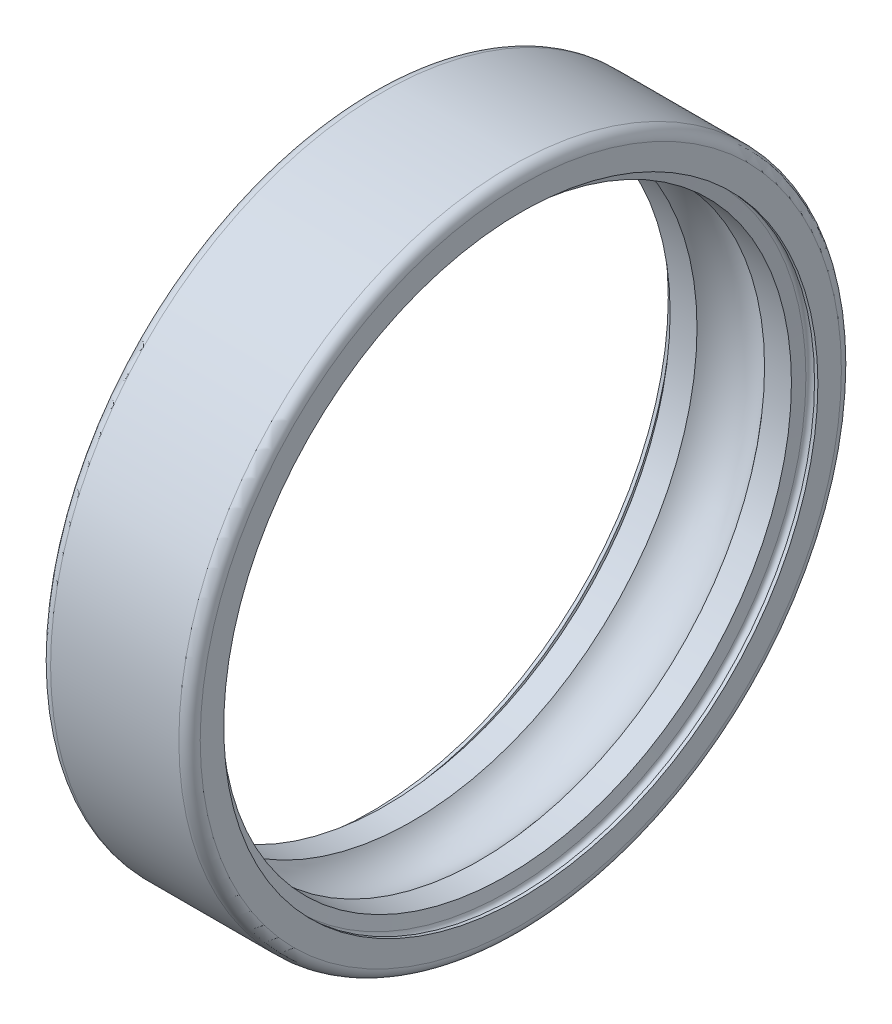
ISO-10303-21;
HEADER;
FILE_DESCRIPTION(('STEP AP214'),'2;1');
FILE_NAME('part.step','',(''),(''),'','','');
FILE_SCHEMA(('AUTOMOTIVE_DESIGN { 1 0 10303 214 1 1 1 1 }'));
ENDSEC;
DATA;
#1=APPLICATION_CONTEXT('core data for automotive mechanical design processes');
#2=APPLICATION_PROTOCOL_DEFINITION('international standard','automotive_design',2000,#1);
#3=PRODUCT_CONTEXT('',#1,'mechanical');
#4=PRODUCT('Part','Part','',(#3));
#5=PRODUCT_RELATED_PRODUCT_CATEGORY('part','',(#4));
#6=PRODUCT_DEFINITION_FORMATION('','',#4);
#7=PRODUCT_DEFINITION_CONTEXT('part definition',#1,'design');
#8=PRODUCT_DEFINITION('design','',#6,#7);
#9=PRODUCT_DEFINITION_SHAPE('','',#8);
#10=(LENGTH_UNIT() NAMED_UNIT(*) SI_UNIT(.MILLI.,.METRE.));
#11=(NAMED_UNIT(*) PLANE_ANGLE_UNIT() SI_UNIT($,.RADIAN.));
#12=(NAMED_UNIT(*) SI_UNIT($,.STERADIAN.) SOLID_ANGLE_UNIT());
#13=UNCERTAINTY_MEASURE_WITH_UNIT(LENGTH_MEASURE(1.E-05),#10,'distance_accuracy_value','');
#14=(GEOMETRIC_REPRESENTATION_CONTEXT(3) GLOBAL_UNCERTAINTY_ASSIGNED_CONTEXT((#13)) GLOBAL_UNIT_ASSIGNED_CONTEXT((#10,
#11,#12)) REPRESENTATION_CONTEXT('',''));
#15=CARTESIAN_POINT('',(0.,0.,0.));
#16=DIRECTION('',(0.,0.,1.));
#17=DIRECTION('',(1.,0.,0.));
#18=AXIS2_PLACEMENT_3D('',#15,#16,#17);
#19=CARTESIAN_POINT('',(0.999999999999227,0.,0.));
#20=DIRECTION('',(1.,0.,0.));
#21=DIRECTION('',(0.,0.,-1.));
#22=AXIS2_PLACEMENT_3D('',#19,#20,#21);
#23=TOROIDAL_SURFACE('',#22,30.0000000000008,0.999999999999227);
#24=CARTESIAN_POINT('',(0.,0.,0.));
#25=DIRECTION('',(1.,0.,0.));
#26=DIRECTION('',(0.,0.,-1.));
#27=AXIS2_PLACEMENT_3D('',#24,#25,#26);
#28=CIRCLE('',#27,30.);
#29=CARTESIAN_POINT('',(0.,0.,-30.));
#30=VERTEX_POINT('',#29);
#31=EDGE_CURVE('E10',#30,#30,#28,.T.);
#32=ORIENTED_EDGE('',*,*,#31,.T.);
#33=EDGE_LOOP('',(#32));
#34=FACE_BOUND('',#33,.T.);
#35=CARTESIAN_POINT('',(0.999999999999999,0.,0.));
#36=DIRECTION('',(1.,0.,0.));
#37=DIRECTION('',(0.,0.,-1.));
#38=AXIS2_PLACEMENT_3D('',#35,#36,#37);
#39=CIRCLE('',#38,31.);
#40=CARTESIAN_POINT('',(0.999999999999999,0.,-31.));
#41=VERTEX_POINT('',#40);
#42=EDGE_CURVE('E77',#41,#41,#39,.T.);
#43=ORIENTED_EDGE('',*,*,#42,.F.);
#44=EDGE_LOOP('',(#43));
#45=FACE_BOUND('',#44,.T.);
#46=ADVANCED_FACE('F31',(#34,#45),#23,.T.);
#47=CARTESIAN_POINT('',(0.,30.,0.));
#48=DIRECTION('',(-1.,0.,0.));
#49=DIRECTION('',(0.,0.,1.));
#50=AXIS2_PLACEMENT_3D('',#47,#48,#49);
#51=PLANE('',#50);
#52=CARTESIAN_POINT('',(0.,0.,0.));
#53=DIRECTION('',(1.,0.,0.));
#54=DIRECTION('',(0.,0.,-1.));
#55=AXIS2_PLACEMENT_3D('',#52,#53,#54);
#56=CIRCLE('',#55,27.8);
#57=CARTESIAN_POINT('',(0.,0.,-27.8));
#58=VERTEX_POINT('',#57);
#59=EDGE_CURVE('E37',#58,#58,#56,.T.);
#60=ORIENTED_EDGE('',*,*,#59,.T.);
#61=EDGE_LOOP('',(#60));
#62=FACE_BOUND('',#61,.T.);
#63=ORIENTED_EDGE('',*,*,#31,.F.);
#64=EDGE_LOOP('',(#63));
#65=FACE_BOUND('',#64,.T.);
#66=ADVANCED_FACE('F85',(#62,#65),#51,.T.);
#67=CARTESIAN_POINT('',(13.,0.,0.));
#68=DIRECTION('',(1.,0.,0.));
#69=DIRECTION('',(0.,0.,-1.));
#70=AXIS2_PLACEMENT_3D('',#67,#68,#69);
#71=CYLINDRICAL_SURFACE('',#70,27.8);
#72=CARTESIAN_POINT('',(0.314222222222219,0.,0.));
#73=DIRECTION('',(1.,0.,0.));
#74=DIRECTION('',(0.,0.,-1.));
#75=AXIS2_PLACEMENT_3D('',#72,#73,#74);
#76=CIRCLE('',#75,27.8);
#77=CARTESIAN_POINT('',(0.314222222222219,0.,-27.8));
#78=VERTEX_POINT('',#77);
#79=EDGE_CURVE('E41',#78,#78,#76,.T.);
#80=ORIENTED_EDGE('',*,*,#79,.T.);
#81=EDGE_LOOP('',(#80));
#82=FACE_BOUND('',#81,.T.);
#83=ORIENTED_EDGE('',*,*,#59,.F.);
#84=EDGE_LOOP('',(#83));
#85=FACE_BOUND('',#84,.T.);
#86=ADVANCED_FACE('F89',(#82,#85),#71,.F.);
#87=CARTESIAN_POINT('',(0.71822222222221,0.,0.));
#88=DIRECTION('',(1.,0.,0.));
#89=DIRECTION('',(0.,0.,-1.));
#90=AXIS2_PLACEMENT_3D('',#87,#88,#89);
#91=TOROIDAL_SURFACE('',#90,27.8,0.40399999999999);
#92=CARTESIAN_POINT('',(1.1222222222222,0.,0.));
#93=DIRECTION('',(1.,0.,0.));
#94=DIRECTION('',(0.,0.,-1.));
#95=AXIS2_PLACEMENT_3D('',#92,#93,#94);
#96=CIRCLE('',#95,27.8);
#97=CARTESIAN_POINT('',(1.1222222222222,0.,-27.8));
#98=VERTEX_POINT('',#97);
#99=EDGE_CURVE('E45',#98,#98,#96,.T.);
#100=ORIENTED_EDGE('',*,*,#99,.T.);
#101=EDGE_LOOP('',(#100));
#102=FACE_BOUND('',#101,.T.);
#103=ORIENTED_EDGE('',*,*,#79,.F.);
#104=EDGE_LOOP('',(#103));
#105=FACE_BOUND('',#104,.T.);
#106=ADVANCED_FACE('F93',(#102,#105),#91,.F.);
#107=CARTESIAN_POINT('',(1.1222222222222,0.,0.));
#108=DIRECTION('',(-1.,0.,0.));
#109=DIRECTION('',(0.,0.,1.));
#110=AXIS2_PLACEMENT_3D('',#107,#108,#109);
#111=CONICAL_SURFACE('',#110,27.8,1.39626340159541);
#112=CARTESIAN_POINT('',(1.324998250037,0.,0.));
#113=DIRECTION('',(1.,0.,0.));
#114=DIRECTION('',(0.,0.,-1.));
#115=AXIS2_PLACEMENT_3D('',#112,#113,#114);
#116=CIRCLE('',#115,26.65);
#117=CARTESIAN_POINT('',(1.324998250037,0.,-26.65));
#118=VERTEX_POINT('',#117);
#119=EDGE_CURVE('E50',#118,#118,#116,.T.);
#120=ORIENTED_EDGE('',*,*,#119,.T.);
#121=EDGE_LOOP('',(#120));
#122=FACE_BOUND('',#121,.T.);
#123=ORIENTED_EDGE('',*,*,#99,.F.);
#124=EDGE_LOOP('',(#123));
#125=FACE_BOUND('',#124,.T.);
#126=ADVANCED_FACE('F100',(#122,#125),#111,.F.);
#127=CARTESIAN_POINT('',(13.,0.,0.));
#128=DIRECTION('',(1.,0.,0.));
#129=DIRECTION('',(0.,0.,-1.));
#130=AXIS2_PLACEMENT_3D('',#127,#128,#129);
#131=CYLINDRICAL_SURFACE('',#130,26.65);
#132=CARTESIAN_POINT('',(3.8388354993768,0.,0.));
#133=DIRECTION('',(1.,0.,0.));
#134=DIRECTION('',(0.,0.,-1.));
#135=AXIS2_PLACEMENT_3D('',#132,#133,#134);
#136=CIRCLE('',#135,26.65);
#137=CARTESIAN_POINT('',(3.8388354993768,0.,-26.65));
#138=VERTEX_POINT('',#137);
#139=EDGE_CURVE('E53',#138,#138,#136,.T.);
#140=ORIENTED_EDGE('',*,*,#139,.T.);
#141=EDGE_LOOP('',(#140));
#142=FACE_BOUND('',#141,.T.);
#143=ORIENTED_EDGE('',*,*,#119,.F.);
#144=EDGE_LOOP('',(#143));
#145=FACE_BOUND('',#144,.T.);
#146=ADVANCED_FACE('F104',(#142,#145),#131,.F.);
#147=CARTESIAN_POINT('',(6.9999999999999,0.,0.));
#148=DIRECTION('',(1.,0.,0.));
#149=DIRECTION('',(0.,0.,-1.));
#150=AXIS2_PLACEMENT_3D('',#147,#148,#149);
#151=TOROIDAL_SURFACE('',#150,24.2500000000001,3.96899999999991);
#152=CARTESIAN_POINT('',(10.161164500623,0.,0.));
#153=DIRECTION('',(1.,0.,0.));
#154=DIRECTION('',(0.,0.,-1.));
#155=AXIS2_PLACEMENT_3D('',#152,#153,#154);
#156=CIRCLE('',#155,26.65);
#157=CARTESIAN_POINT('',(10.161164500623,0.,-26.65));
#158=VERTEX_POINT('',#157);
#159=EDGE_CURVE('E56',#158,#158,#156,.T.);
#160=ORIENTED_EDGE('',*,*,#159,.T.);
#161=EDGE_LOOP('',(#160));
#162=FACE_BOUND('',#161,.T.);
#163=ORIENTED_EDGE('',*,*,#139,.F.);
#164=EDGE_LOOP('',(#163));
#165=FACE_BOUND('',#164,.T.);
#166=ADVANCED_FACE('F108',(#162,#165),#151,.F.);
#167=CARTESIAN_POINT('',(13.,0.,0.));
#168=DIRECTION('',(1.,0.,0.));
#169=DIRECTION('',(0.,0.,-1.));
#170=AXIS2_PLACEMENT_3D('',#167,#168,#169);
#171=CYLINDRICAL_SURFACE('',#170,26.65);
#172=CARTESIAN_POINT('',(12.675001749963,0.,0.));
#173=DIRECTION('',(1.,0.,0.));
#174=DIRECTION('',(0.,0.,-1.));
#175=AXIS2_PLACEMENT_3D('',#172,#173,#174);
#176=CIRCLE('',#175,26.65);
#177=CARTESIAN_POINT('',(12.675001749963,0.,-26.65));
#178=VERTEX_POINT('',#177);
#179=EDGE_CURVE('E59',#178,#178,#176,.T.);
#180=ORIENTED_EDGE('',*,*,#179,.T.);
#181=EDGE_LOOP('',(#180));
#182=FACE_BOUND('',#181,.T.);
#183=ORIENTED_EDGE('',*,*,#159,.F.);
#184=EDGE_LOOP('',(#183));
#185=FACE_BOUND('',#184,.T.);
#186=ADVANCED_FACE('F112',(#182,#185),#171,.F.);
#187=CARTESIAN_POINT('',(12.675001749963,0.,0.));
#188=DIRECTION('',(1.,0.,0.));
#189=DIRECTION('',(0.,0.,-1.));
#190=AXIS2_PLACEMENT_3D('',#187,#188,#189);
#191=CONICAL_SURFACE('',#190,26.65,1.39626340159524);
#192=CARTESIAN_POINT('',(12.877777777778,0.,0.));
#193=DIRECTION('',(1.,0.,0.));
#194=DIRECTION('',(0.,0.,-1.));
#195=AXIS2_PLACEMENT_3D('',#192,#193,#194);
#196=CIRCLE('',#195,27.8);
#197=CARTESIAN_POINT('',(12.877777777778,0.,-27.8));
#198=VERTEX_POINT('',#197);
#199=EDGE_CURVE('E62',#198,#198,#196,.T.);
#200=ORIENTED_EDGE('',*,*,#199,.T.);
#201=EDGE_LOOP('',(#200));
#202=FACE_BOUND('',#201,.T.);
#203=ORIENTED_EDGE('',*,*,#179,.F.);
#204=EDGE_LOOP('',(#203));
#205=FACE_BOUND('',#204,.T.);
#206=ADVANCED_FACE('F116',(#202,#205),#191,.F.);
#207=CARTESIAN_POINT('',(13.281777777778,0.,0.));
#208=DIRECTION('',(1.,0.,0.));
#209=DIRECTION('',(0.,0.,-1.));
#210=AXIS2_PLACEMENT_3D('',#207,#208,#209);
#211=TOROIDAL_SURFACE('',#210,27.8,0.404);
#212=CARTESIAN_POINT('',(13.685777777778,0.,0.));
#213=DIRECTION('',(1.,0.,0.));
#214=DIRECTION('',(0.,0.,-1.));
#215=AXIS2_PLACEMENT_3D('',#212,#213,#214);
#216=CIRCLE('',#215,27.8);
#217=CARTESIAN_POINT('',(13.685777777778,0.,-27.8));
#218=VERTEX_POINT('',#217);
#219=EDGE_CURVE('E65',#218,#218,#216,.T.);
#220=ORIENTED_EDGE('',*,*,#219,.T.);
#221=EDGE_LOOP('',(#220));
#222=FACE_BOUND('',#221,.T.);
#223=ORIENTED_EDGE('',*,*,#199,.F.);
#224=EDGE_LOOP('',(#223));
#225=FACE_BOUND('',#224,.T.);
#226=ADVANCED_FACE('F120',(#222,#225),#211,.F.);
#227=CARTESIAN_POINT('',(13.,0.,0.));
#228=DIRECTION('',(1.,0.,0.));
#229=DIRECTION('',(0.,0.,-1.));
#230=AXIS2_PLACEMENT_3D('',#227,#228,#229);
#231=CYLINDRICAL_SURFACE('',#230,27.8);
#232=CARTESIAN_POINT('',(14.,0.,0.));
#233=DIRECTION('',(1.,0.,0.));
#234=DIRECTION('',(0.,0.,-1.));
#235=AXIS2_PLACEMENT_3D('',#232,#233,#234);
#236=CIRCLE('',#235,27.8);
#237=CARTESIAN_POINT('',(14.,0.,-27.8));
#238=VERTEX_POINT('',#237);
#239=EDGE_CURVE('E68',#238,#238,#236,.T.);
#240=ORIENTED_EDGE('',*,*,#239,.T.);
#241=EDGE_LOOP('',(#240));
#242=FACE_BOUND('',#241,.T.);
#243=ORIENTED_EDGE('',*,*,#219,.F.);
#244=EDGE_LOOP('',(#243));
#245=FACE_BOUND('',#244,.T.);
#246=ADVANCED_FACE('F124',(#242,#245),#231,.F.);
#247=CARTESIAN_POINT('',(14.,27.8,0.));
#248=DIRECTION('',(1.,0.,0.));
#249=DIRECTION('',(0.,0.,-1.));
#250=AXIS2_PLACEMENT_3D('',#247,#248,#249);
#251=PLANE('',#250);
#252=CARTESIAN_POINT('',(14.,0.,0.));
#253=DIRECTION('',(1.,0.,0.));
#254=DIRECTION('',(0.,0.,-1.));
#255=AXIS2_PLACEMENT_3D('',#252,#253,#254);
#256=CIRCLE('',#255,30.);
#257=CARTESIAN_POINT('',(14.,0.,-30.));
#258=VERTEX_POINT('',#257);
#259=EDGE_CURVE('E71',#258,#258,#256,.T.);
#260=ORIENTED_EDGE('',*,*,#259,.T.);
#261=EDGE_LOOP('',(#260));
#262=FACE_BOUND('',#261,.T.);
#263=ORIENTED_EDGE('',*,*,#239,.F.);
#264=EDGE_LOOP('',(#263));
#265=FACE_BOUND('',#264,.T.);
#266=ADVANCED_FACE('F128',(#262,#265),#251,.T.);
#267=CARTESIAN_POINT('',(13.0000000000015,0.,0.));
#268=DIRECTION('',(1.,0.,0.));
#269=DIRECTION('',(0.,0.,-1.));
#270=AXIS2_PLACEMENT_3D('',#267,#268,#269);
#271=TOROIDAL_SURFACE('',#270,30.0000000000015,0.999999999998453);
#272=CARTESIAN_POINT('',(13.,0.,0.));
#273=DIRECTION('',(1.,0.,0.));
#274=DIRECTION('',(0.,0.,-1.));
#275=AXIS2_PLACEMENT_3D('',#272,#273,#274);
#276=CIRCLE('',#275,31.);
#277=CARTESIAN_POINT('',(13.,0.,-31.));
#278=VERTEX_POINT('',#277);
#279=EDGE_CURVE('E74',#278,#278,#276,.T.);
#280=ORIENTED_EDGE('',*,*,#279,.T.);
#281=EDGE_LOOP('',(#280));
#282=FACE_BOUND('',#281,.T.);
#283=ORIENTED_EDGE('',*,*,#259,.F.);
#284=EDGE_LOOP('',(#283));
#285=FACE_BOUND('',#284,.T.);
#286=ADVANCED_FACE('F132',(#282,#285),#271,.T.);
#287=CARTESIAN_POINT('',(13.,0.,0.));
#288=DIRECTION('',(1.,0.,0.));
#289=DIRECTION('',(0.,0.,-1.));
#290=AXIS2_PLACEMENT_3D('',#287,#288,#289);
#291=CYLINDRICAL_SURFACE('',#290,31.);
#292=ORIENTED_EDGE('',*,*,#42,.T.);
#293=EDGE_LOOP('',(#292));
#294=FACE_BOUND('',#293,.T.);
#295=ORIENTED_EDGE('',*,*,#279,.F.);
#296=EDGE_LOOP('',(#295));
#297=FACE_BOUND('',#296,.T.);
#298=ADVANCED_FACE('F81',(#294,#297),#291,.T.);
#299=CLOSED_SHELL('',(#46,#66,#86,#106,#126,#146,#166,#186,#206,#226,#246,#266,#286,#298));
#300=MANIFOLD_SOLID_BREP('B2',#299);
#301=ADVANCED_BREP_SHAPE_REPRESENTATION('',(#18,#300),#14);
#302=SHAPE_DEFINITION_REPRESENTATION(#9,#301);
ENDSEC;
END-ISO-10303-21;
